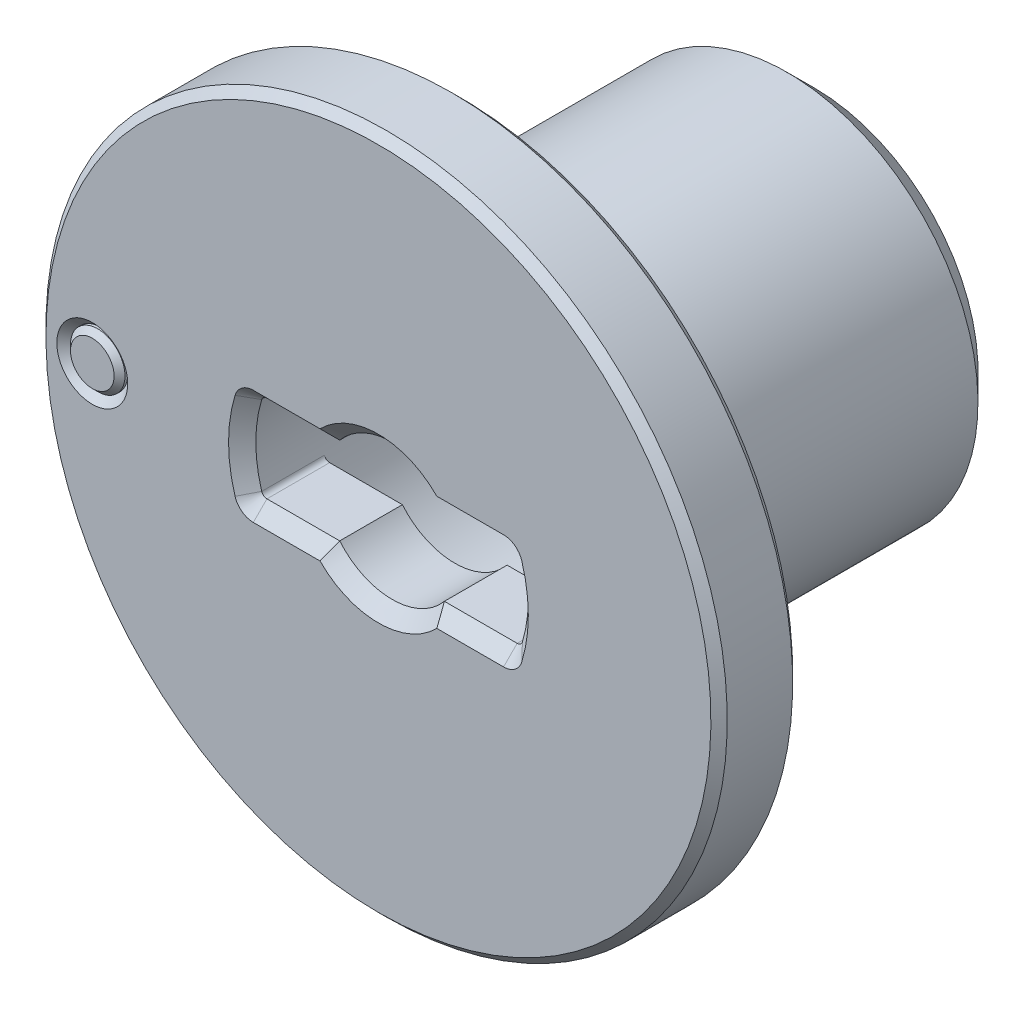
ISO-10303-21;
HEADER;
FILE_DESCRIPTION(('STEP AP214'),'2;1');
FILE_NAME('part.step','',(''),(''),'','','');
FILE_SCHEMA(('AUTOMOTIVE_DESIGN { 1 0 10303 214 1 1 1 1 }'));
ENDSEC;
DATA;
#1=APPLICATION_CONTEXT('core data for automotive mechanical design processes');
#2=APPLICATION_PROTOCOL_DEFINITION('international standard','automotive_design',2000,#1);
#3=PRODUCT_CONTEXT('',#1,'mechanical');
#4=PRODUCT('Part','Part','',(#3));
#5=PRODUCT_RELATED_PRODUCT_CATEGORY('part','',(#4));
#6=PRODUCT_DEFINITION_FORMATION('','',#4);
#7=PRODUCT_DEFINITION_CONTEXT('part definition',#1,'design');
#8=PRODUCT_DEFINITION('design','',#6,#7);
#9=PRODUCT_DEFINITION_SHAPE('','',#8);
#10=(LENGTH_UNIT() NAMED_UNIT(*) SI_UNIT(.MILLI.,.METRE.));
#11=(NAMED_UNIT(*) PLANE_ANGLE_UNIT() SI_UNIT($,.RADIAN.));
#12=(NAMED_UNIT(*) SI_UNIT($,.STERADIAN.) SOLID_ANGLE_UNIT());
#13=UNCERTAINTY_MEASURE_WITH_UNIT(LENGTH_MEASURE(1.E-05),#10,'distance_accuracy_value','');
#14=(GEOMETRIC_REPRESENTATION_CONTEXT(3) GLOBAL_UNCERTAINTY_ASSIGNED_CONTEXT((#13)) GLOBAL_UNIT_ASSIGNED_CONTEXT((#10,
#11,#12)) REPRESENTATION_CONTEXT('',''));
#15=CARTESIAN_POINT('',(0.,0.,0.));
#16=DIRECTION('',(0.,0.,1.));
#17=DIRECTION('',(1.,0.,0.));
#18=AXIS2_PLACEMENT_3D('',#15,#16,#17);
#19=CARTESIAN_POINT('',(-10.5,0.,3.));
#20=DIRECTION('',(0.,0.,1.));
#21=DIRECTION('',(1.,0.,0.));
#22=AXIS2_PLACEMENT_3D('',#19,#20,#21);
#23=PLANE('',#22);
#24=CARTESIAN_POINT('',(-10.5,0.,3.));
#25=DIRECTION('',(0.,0.,1.));
#26=DIRECTION('',(1.,0.,0.));
#27=AXIS2_PLACEMENT_3D('',#24,#25,#26);
#28=CIRCLE('',#27,0.8);
#29=CARTESIAN_POINT('',(-9.7,0.,3.));
#30=VERTEX_POINT('',#29);
#31=EDGE_CURVE('E333',#30,#30,#28,.T.);
#32=ORIENTED_EDGE('',*,*,#31,.T.);
#33=EDGE_LOOP('',(#32));
#34=FACE_BOUND('',#33,.T.);
#35=ADVANCED_FACE('F14',(#34),#23,.T.);
#36=CARTESIAN_POINT('',(-10.5,0.,3.));
#37=DIRECTION('',(0.,0.,-1.));
#38=DIRECTION('',(-1.,0.,0.));
#39=AXIS2_PLACEMENT_3D('',#36,#37,#38);
#40=CONICAL_SURFACE('',#39,0.8,0.785398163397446);
#41=CARTESIAN_POINT('',(-10.5,0.,2.8));
#42=DIRECTION('',(0.,0.,1.));
#43=DIRECTION('',(1.,0.,0.));
#44=AXIS2_PLACEMENT_3D('',#41,#42,#43);
#45=CIRCLE('',#44,1.);
#46=CARTESIAN_POINT('',(-9.5,0.,2.8));
#47=VERTEX_POINT('',#46);
#48=EDGE_CURVE('E335',#47,#47,#45,.F.);
#49=ORIENTED_EDGE('',*,*,#48,.F.);
#50=EDGE_LOOP('',(#49));
#51=FACE_BOUND('',#50,.T.);
#52=ORIENTED_EDGE('',*,*,#31,.F.);
#53=EDGE_LOOP('',(#52));
#54=FACE_BOUND('',#53,.T.);
#55=ADVANCED_FACE('F315',(#51,#54),#40,.T.);
#56=CARTESIAN_POINT('',(-10.5,0.,3.));
#57=DIRECTION('',(0.,0.,-1.));
#58=DIRECTION('',(-1.,0.,0.));
#59=AXIS2_PLACEMENT_3D('',#56,#57,#58);
#60=CYLINDRICAL_SURFACE('',#59,1.);
#61=CARTESIAN_POINT('',(-10.5,0.,2.7));
#62=DIRECTION('',(0.,0.,1.));
#63=DIRECTION('',(0.,-1.,0.));
#64=AXIS2_PLACEMENT_3D('',#61,#62,#63);
#65=CIRCLE('',#64,1.);
#66=CARTESIAN_POINT('',(-10.5,-1.,2.7));
#67=VERTEX_POINT('',#66);
#68=EDGE_CURVE('E23',#67,#67,#65,.T.);
#69=ORIENTED_EDGE('',*,*,#68,.T.);
#70=EDGE_LOOP('',(#69));
#71=FACE_BOUND('',#70,.T.);
#72=ORIENTED_EDGE('',*,*,#48,.T.);
#73=EDGE_LOOP('',(#72));
#74=FACE_BOUND('',#73,.T.);
#75=ADVANCED_FACE('F298',(#71,#74),#60,.T.);
#76=CARTESIAN_POINT('',(-10.5,0.,0.3));
#77=DIRECTION('',(0.,0.,-1.));
#78=DIRECTION('',(0.,1.,0.));
#79=AXIS2_PLACEMENT_3D('',#76,#77,#78);
#80=CIRCLE('',#79,1.);
#81=CARTESIAN_POINT('',(-10.5,1.,0.3));
#82=VERTEX_POINT('',#81);
#83=EDGE_CURVE('E9',#82,#82,#80,.T.);
#84=ORIENTED_EDGE('',*,*,#83,.T.);
#85=EDGE_LOOP('',(#84));
#86=FACE_BOUND('',#85,.T.);
#87=CARTESIAN_POINT('',(-10.5,0.,-1.65));
#88=DIRECTION('',(0.,0.,1.));
#89=DIRECTION('',(1.,0.,0.));
#90=AXIS2_PLACEMENT_3D('',#87,#88,#89);
#91=CIRCLE('',#90,1.);
#92=CARTESIAN_POINT('',(-9.5,0.,-1.65));
#93=VERTEX_POINT('',#92);
#94=EDGE_CURVE('E338',#93,#93,#91,.T.);
#95=ORIENTED_EDGE('',*,*,#94,.T.);
#96=EDGE_LOOP('',(#95));
#97=FACE_BOUND('',#96,.T.);
#98=ADVANCED_FACE('F310',(#86,#97),#60,.T.);
#99=CARTESIAN_POINT('',(-10.5,0.,-2.));
#100=DIRECTION('',(0.,0.,1.));
#101=DIRECTION('',(1.,0.,0.));
#102=AXIS2_PLACEMENT_3D('',#99,#100,#101);
#103=PLANE('',#102);
#104=CARTESIAN_POINT('',(-10.5,0.,-2.));
#105=DIRECTION('',(0.,0.,1.));
#106=DIRECTION('',(1.,0.,0.));
#107=AXIS2_PLACEMENT_3D('',#104,#105,#106);
#108=CIRCLE('',#107,0.906217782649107);
#109=CARTESIAN_POINT('',(-9.59378221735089,0.,-2.));
#110=VERTEX_POINT('',#109);
#111=EDGE_CURVE('E344',#110,#110,#108,.F.);
#112=ORIENTED_EDGE('',*,*,#111,.T.);
#113=EDGE_LOOP('',(#112));
#114=FACE_BOUND('',#113,.T.);
#115=ADVANCED_FACE('F313',(#114),#103,.F.);
#116=CARTESIAN_POINT('',(-10.5,0.,-1.65));
#117=DIRECTION('',(0.,0.,1.));
#118=DIRECTION('',(1.,0.,0.));
#119=AXIS2_PLACEMENT_3D('',#116,#117,#118);
#120=CONICAL_SURFACE('',#119,1.,0.261799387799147);
#121=ORIENTED_EDGE('',*,*,#111,.F.);
#122=EDGE_LOOP('',(#121));
#123=FACE_BOUND('',#122,.T.);
#124=ORIENTED_EDGE('',*,*,#94,.F.);
#125=EDGE_LOOP('',(#124));
#126=FACE_BOUND('',#125,.T.);
#127=ADVANCED_FACE('F255',(#123,#126),#120,.T.);
#128=CARTESIAN_POINT('',(0.,0.,-12.));
#129=DIRECTION('',(0.,0.,1.));
#130=DIRECTION('',(0.,-1.,0.));
#131=AXIS2_PLACEMENT_3D('',#128,#129,#130);
#132=CONICAL_SURFACE('',#131,7.,0.785398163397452);
#133=CARTESIAN_POINT('',(0.,0.,-13.));
#134=DIRECTION('',(0.,0.,1.));
#135=DIRECTION('',(0.,-1.,0.));
#136=AXIS2_PLACEMENT_3D('',#133,#134,#135);
#137=CIRCLE('',#136,6.);
#138=CARTESIAN_POINT('',(0.,-6.,-13.));
#139=VERTEX_POINT('',#138);
#140=EDGE_CURVE('E397',#139,#139,#137,.F.);
#141=ORIENTED_EDGE('',*,*,#140,.F.);
#142=EDGE_LOOP('',(#141));
#143=FACE_BOUND('',#142,.T.);
#144=CARTESIAN_POINT('',(0.,0.,-12.));
#145=DIRECTION('',(0.,0.,1.));
#146=DIRECTION('',(0.,-1.,0.));
#147=AXIS2_PLACEMENT_3D('',#144,#145,#146);
#148=CIRCLE('',#147,7.);
#149=CARTESIAN_POINT('',(0.,-7.,-12.));
#150=VERTEX_POINT('',#149);
#151=EDGE_CURVE('E394',#150,#150,#148,.T.);
#152=ORIENTED_EDGE('',*,*,#151,.F.);
#153=EDGE_LOOP('',(#152));
#154=FACE_BOUND('',#153,.T.);
#155=ADVANCED_FACE('F250',(#143,#154),#132,.T.);
#156=CARTESIAN_POINT('',(7.,0.,-13.));
#157=DIRECTION('',(0.,0.,1.));
#158=DIRECTION('',(0.,-1.,0.));
#159=AXIS2_PLACEMENT_3D('',#156,#157,#158);
#160=PLANE('',#159);
#161=ORIENTED_EDGE('',*,*,#140,.T.);
#162=EDGE_LOOP('',(#161));
#163=FACE_BOUND('',#162,.T.);
#164=CARTESIAN_POINT('',(0.,0.,-13.));
#165=DIRECTION('',(0.,0.,1.));
#166=DIRECTION('',(0.,-1.,0.));
#167=AXIS2_PLACEMENT_3D('',#164,#165,#166);
#168=CIRCLE('',#167,5.);
#169=CARTESIAN_POINT('',(0.,-5.,-13.));
#170=VERTEX_POINT('',#169);
#171=EDGE_CURVE('E370',#170,#170,#168,.T.);
#172=ORIENTED_EDGE('',*,*,#171,.T.);
#173=EDGE_LOOP('',(#172));
#174=FACE_BOUND('',#173,.T.);
#175=ADVANCED_FACE('F254',(#163,#174),#160,.F.);
#176=CARTESIAN_POINT('',(0.,0.,0.2));
#177=DIRECTION('',(0.,0.,1.));
#178=DIRECTION('',(0.,-1.,0.));
#179=AXIS2_PLACEMENT_3D('',#176,#177,#178);
#180=PLANE('',#179);
#181=CARTESIAN_POINT('',(0.,0.,0.2));
#182=DIRECTION('',(0.,0.,1.));
#183=DIRECTION('',(0.,-1.,0.));
#184=AXIS2_PLACEMENT_3D('',#181,#182,#183);
#185=CIRCLE('',#184,5.);
#186=CARTESIAN_POINT('',(-4.78260011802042,-1.45833333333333,0.2));
#187=VERTEX_POINT('',#186);
#188=CARTESIAN_POINT('',(4.78260011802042,-1.45833333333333,0.2));
#189=VERTEX_POINT('',#188);
#190=EDGE_CURVE('E39',#187,#189,#185,.T.);
#191=ORIENTED_EDGE('',*,*,#190,.F.);
#192=CARTESIAN_POINT('',(-4.5912961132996,-1.4,0.2));
#193=DIRECTION('',(0.,0.,1.));
#194=DIRECTION('',(0.,-1.,0.));
#195=AXIS2_PLACEMENT_3D('',#192,#193,#194);
#196=CIRCLE('',#195,0.2);
#197=CARTESIAN_POINT('',(-4.5912961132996,-1.6,0.2));
#198=VERTEX_POINT('',#197);
#199=EDGE_CURVE('E18',#198,#187,#196,.F.);
#200=ORIENTED_EDGE('',*,*,#199,.F.);
#201=DIRECTION('',(-1.,0.,0.));
#202=VECTOR('',#201,1.);
#203=CARTESIAN_POINT('',(-4.73708771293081,-1.6,0.2));
#204=LINE('',#203,#202);
#205=CARTESIAN_POINT('',(-1.92093727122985,-1.6,0.2));
#206=VERTEX_POINT('',#205);
#207=EDGE_CURVE('E349',#206,#198,#204,.T.);
#208=ORIENTED_EDGE('',*,*,#207,.F.);
#209=CARTESIAN_POINT('',(0.,0.,0.2));
#210=DIRECTION('',(0.,0.,1.));
#211=DIRECTION('',(0.,-1.,0.));
#212=AXIS2_PLACEMENT_3D('',#209,#210,#211);
#213=CIRCLE('',#212,2.5);
#214=CARTESIAN_POINT('',(1.92093727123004,-1.59999999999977,0.2));
#215=VERTEX_POINT('',#214);
#216=EDGE_CURVE('E352',#215,#206,#213,.F.);
#217=ORIENTED_EDGE('',*,*,#216,.F.);
#218=DIRECTION('',(-1.,0.,0.));
#219=VECTOR('',#218,1.);
#220=CARTESIAN_POINT('',(-4.73708771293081,-1.6,0.2));
#221=LINE('',#220,#219);
#222=CARTESIAN_POINT('',(4.5912961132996,-1.6,0.2));
#223=VERTEX_POINT('',#222);
#224=EDGE_CURVE('E142',#223,#215,#221,.T.);
#225=ORIENTED_EDGE('',*,*,#224,.F.);
#226=CARTESIAN_POINT('',(4.5912961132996,-1.4,0.2));
#227=DIRECTION('',(0.,0.,1.));
#228=DIRECTION('',(0.,-1.,0.));
#229=AXIS2_PLACEMENT_3D('',#226,#227,#228);
#230=CIRCLE('',#229,0.2);
#231=EDGE_CURVE('E139',#189,#223,#230,.F.);
#232=ORIENTED_EDGE('',*,*,#231,.F.);
#233=EDGE_LOOP('',(#191,#200,#208,#217,#225,#232));
#234=FACE_BOUND('',#233,.T.);
#235=ADVANCED_FACE('F140',(#234),#180,.F.);
#236=DIRECTION('',(1.,0.,0.));
#237=VECTOR('',#236,1.);
#238=CARTESIAN_POINT('',(-4.73708771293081,1.6,0.2));
#239=LINE('',#238,#237);
#240=CARTESIAN_POINT('',(1.92093727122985,1.6,0.2));
#241=VERTEX_POINT('',#240);
#242=CARTESIAN_POINT('',(4.5912961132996,1.6,0.2));
#243=VERTEX_POINT('',#242);
#244=EDGE_CURVE('E361',#241,#243,#239,.T.);
#245=ORIENTED_EDGE('',*,*,#244,.F.);
#246=CARTESIAN_POINT('',(0.,0.,0.2));
#247=DIRECTION('',(0.,0.,1.));
#248=DIRECTION('',(0.,-1.,0.));
#249=AXIS2_PLACEMENT_3D('',#246,#247,#248);
#250=CIRCLE('',#249,2.5);
#251=CARTESIAN_POINT('',(-1.92093727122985,1.6,0.2));
#252=VERTEX_POINT('',#251);
#253=EDGE_CURVE('E358',#252,#241,#250,.F.);
#254=ORIENTED_EDGE('',*,*,#253,.F.);
#255=DIRECTION('',(1.,0.,0.));
#256=VECTOR('',#255,1.);
#257=CARTESIAN_POINT('',(-4.73708771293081,1.6,0.2));
#258=LINE('',#257,#256);
#259=CARTESIAN_POINT('',(-4.5912961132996,1.6,0.2));
#260=VERTEX_POINT('',#259);
#261=EDGE_CURVE('E31',#260,#252,#258,.T.);
#262=ORIENTED_EDGE('',*,*,#261,.F.);
#263=CARTESIAN_POINT('',(-4.5912961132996,1.4,0.2));
#264=DIRECTION('',(0.,0.,1.));
#265=DIRECTION('',(0.,-1.,0.));
#266=AXIS2_PLACEMENT_3D('',#263,#264,#265);
#267=CIRCLE('',#266,0.2);
#268=CARTESIAN_POINT('',(-4.78260011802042,1.45833333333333,0.2));
#269=VERTEX_POINT('',#268);
#270=EDGE_CURVE('E147',#269,#260,#267,.F.);
#271=ORIENTED_EDGE('',*,*,#270,.F.);
#272=CARTESIAN_POINT('',(4.78260011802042,1.45833333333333,0.2));
#273=VERTEX_POINT('',#272);
#274=EDGE_CURVE('E158',#273,#269,#185,.T.);
#275=ORIENTED_EDGE('',*,*,#274,.F.);
#276=CARTESIAN_POINT('',(4.5912961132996,1.4,0.2));
#277=DIRECTION('',(0.,0.,1.));
#278=DIRECTION('',(0.,-1.,0.));
#279=AXIS2_PLACEMENT_3D('',#276,#277,#278);
#280=CIRCLE('',#279,0.2);
#281=EDGE_CURVE('E364',#243,#273,#280,.F.);
#282=ORIENTED_EDGE('',*,*,#281,.F.);
#283=EDGE_LOOP('',(#245,#254,#262,#271,#275,#282));
#284=FACE_BOUND('',#283,.T.);
#285=ADVANCED_FACE('F307',(#284),#180,.F.);
#286=CARTESIAN_POINT('',(-4.73708771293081,1.6,-1.884875));
#287=DIRECTION('',(0.,1.,0.));
#288=DIRECTION('',(-1.,0.,0.));
#289=AXIS2_PLACEMENT_3D('',#286,#287,#288);
#290=PLANE('',#289);
#291=DIRECTION('',(0.,0.,-1.));
#292=VECTOR('',#291,1.);
#293=CARTESIAN_POINT('',(-4.5912961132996,1.6,0.11225012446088));
#294=LINE('',#293,#292);
#295=CARTESIAN_POINT('',(-4.5912961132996,1.6,2.5));
#296=VERTEX_POINT('',#295);
#297=EDGE_CURVE('E174',#296,#260,#294,.T.);
#298=ORIENTED_EDGE('',*,*,#297,.T.);
#299=ORIENTED_EDGE('',*,*,#261,.T.);
#300=DIRECTION('',(0.,0.,1.));
#301=VECTOR('',#300,1.);
#302=CARTESIAN_POINT('',(-1.92093727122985,1.6,-7.));
#303=LINE('',#302,#301);
#304=CARTESIAN_POINT('',(-1.92093727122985,1.6,2.5));
#305=VERTEX_POINT('',#304);
#306=EDGE_CURVE('E377',#305,#252,#303,.F.);
#307=ORIENTED_EDGE('',*,*,#306,.F.);
#308=DIRECTION('',(-1.,0.,0.));
#309=VECTOR('',#308,1.);
#310=CARTESIAN_POINT('',(-4.5912961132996,1.6,2.5));
#311=LINE('',#310,#309);
#312=EDGE_CURVE('E432',#305,#296,#311,.T.);
#313=ORIENTED_EDGE('',*,*,#312,.T.);
#314=EDGE_LOOP('',(#298,#299,#307,#313));
#315=FACE_BOUND('',#314,.T.);
#316=ADVANCED_FACE('F281',(#315),#290,.F.);
#317=CARTESIAN_POINT('',(-4.5912961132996,1.4,3.));
#318=DIRECTION('',(0.,0.,1.));
#319=DIRECTION('',(0.,-1.,0.));
#320=AXIS2_PLACEMENT_3D('',#317,#318,#319);
#321=CYLINDRICAL_SURFACE('',#320,0.2);
#322=DIRECTION('',(0.,0.,1.));
#323=VECTOR('',#322,1.);
#324=CARTESIAN_POINT('',(-4.78260011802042,1.45833333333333,3.));
#325=LINE('',#324,#323);
#326=CARTESIAN_POINT('',(-4.78260011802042,1.45833333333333,2.5));
#327=VERTEX_POINT('',#326);
#328=EDGE_CURVE('E169',#269,#327,#325,.T.);
#329=ORIENTED_EDGE('',*,*,#328,.F.);
#330=ORIENTED_EDGE('',*,*,#270,.T.);
#331=ORIENTED_EDGE('',*,*,#297,.F.);
#332=CARTESIAN_POINT('',(-4.5912961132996,1.4,2.5));
#333=DIRECTION('',(0.,0.,1.));
#334=DIRECTION('',(0.,-1.,0.));
#335=AXIS2_PLACEMENT_3D('',#332,#333,#334);
#336=CIRCLE('',#335,0.2);
#337=EDGE_CURVE('E426',#296,#327,#336,.T.);
#338=ORIENTED_EDGE('',*,*,#337,.T.);
#339=EDGE_LOOP('',(#329,#330,#331,#338));
#340=FACE_BOUND('',#339,.T.);
#341=ADVANCED_FACE('F427',(#340),#321,.F.);
#342=CARTESIAN_POINT('',(-4.5912961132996,-1.4,3.));
#343=DIRECTION('',(0.,0.,1.));
#344=DIRECTION('',(0.,-1.,0.));
#345=AXIS2_PLACEMENT_3D('',#342,#343,#344);
#346=CYLINDRICAL_SURFACE('',#345,0.2);
#347=DIRECTION('',(0.,0.,-1.));
#348=VECTOR('',#347,1.);
#349=CARTESIAN_POINT('',(-4.5912961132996,-1.6,3.));
#350=LINE('',#349,#348);
#351=CARTESIAN_POINT('',(-4.5912961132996,-1.6,2.5));
#352=VERTEX_POINT('',#351);
#353=EDGE_CURVE('E177',#198,#352,#350,.F.);
#354=ORIENTED_EDGE('',*,*,#353,.F.);
#355=ORIENTED_EDGE('',*,*,#199,.T.);
#356=DIRECTION('',(0.,0.,1.));
#357=VECTOR('',#356,1.);
#358=CARTESIAN_POINT('',(-4.78260011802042,-1.45833333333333,3.));
#359=LINE('',#358,#357);
#360=CARTESIAN_POINT('',(-4.78260011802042,-1.45833333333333,2.5));
#361=VERTEX_POINT('',#360);
#362=EDGE_CURVE('E157',#361,#187,#359,.F.);
#363=ORIENTED_EDGE('',*,*,#362,.F.);
#364=CARTESIAN_POINT('',(-4.5912961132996,-1.4,2.5));
#365=DIRECTION('',(0.,0.,1.));
#366=DIRECTION('',(0.,-1.,0.));
#367=AXIS2_PLACEMENT_3D('',#364,#365,#366);
#368=CIRCLE('',#367,0.2);
#369=EDGE_CURVE('E431',#361,#352,#368,.T.);
#370=ORIENTED_EDGE('',*,*,#369,.T.);
#371=EDGE_LOOP('',(#354,#355,#363,#370));
#372=FACE_BOUND('',#371,.T.);
#373=ADVANCED_FACE('F305',(#372),#346,.F.);
#374=CARTESIAN_POINT('',(-4.73708771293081,-1.6,-1.884875));
#375=DIRECTION('',(0.,-1.,0.));
#376=DIRECTION('',(1.,0.,0.));
#377=AXIS2_PLACEMENT_3D('',#374,#375,#376);
#378=PLANE('',#377);
#379=DIRECTION('',(0.,0.,1.));
#380=VECTOR('',#379,1.);
#381=CARTESIAN_POINT('',(-1.92093727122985,-1.6,-7.));
#382=LINE('',#381,#380);
#383=CARTESIAN_POINT('',(-1.92093727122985,-1.6,2.5));
#384=VERTEX_POINT('',#383);
#385=EDGE_CURVE('E368',#206,#384,#382,.T.);
#386=ORIENTED_EDGE('',*,*,#385,.F.);
#387=ORIENTED_EDGE('',*,*,#207,.T.);
#388=ORIENTED_EDGE('',*,*,#353,.T.);
#389=DIRECTION('',(1.,0.,0.));
#390=VECTOR('',#389,1.);
#391=CARTESIAN_POINT('',(-2.53771550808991,-1.6,2.5));
#392=LINE('',#391,#390);
#393=EDGE_CURVE('E456',#352,#384,#392,.T.);
#394=ORIENTED_EDGE('',*,*,#393,.T.);
#395=EDGE_LOOP('',(#386,#387,#388,#394));
#396=FACE_BOUND('',#395,.T.);
#397=ADVANCED_FACE('F301',(#396),#378,.F.);
#398=CARTESIAN_POINT('',(0.,0.,-7.));
#399=DIRECTION('',(0.,0.,1.));
#400=DIRECTION('',(0.,-1.,0.));
#401=AXIS2_PLACEMENT_3D('',#398,#399,#400);
#402=CYLINDRICAL_SURFACE('',#401,2.5);
#403=DIRECTION('',(0.,0.,1.));
#404=VECTOR('',#403,1.);
#405=CARTESIAN_POINT('',(1.92093727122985,-1.6,-7.));
#406=LINE('',#405,#404);
#407=CARTESIAN_POINT('',(1.92093727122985,-1.6,2.5));
#408=VERTEX_POINT('',#407);
#409=EDGE_CURVE('E371',#408,#215,#406,.F.);
#410=ORIENTED_EDGE('',*,*,#409,.T.);
#411=ORIENTED_EDGE('',*,*,#216,.T.);
#412=ORIENTED_EDGE('',*,*,#385,.T.);
#413=CARTESIAN_POINT('',(0.,0.,2.5));
#414=DIRECTION('',(0.,0.,1.));
#415=DIRECTION('',(0.,-1.,0.));
#416=AXIS2_PLACEMENT_3D('',#413,#414,#415);
#417=CIRCLE('',#416,2.5);
#418=EDGE_CURVE('E400',#384,#408,#417,.T.);
#419=ORIENTED_EDGE('',*,*,#418,.T.);
#420=EDGE_LOOP('',(#410,#411,#412,#419));
#421=FACE_BOUND('',#420,.T.);
#422=ADVANCED_FACE('F295',(#421),#402,.F.);
#423=DIRECTION('',(0.,0.,-1.));
#424=VECTOR('',#423,1.);
#425=CARTESIAN_POINT('',(4.5912961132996,-1.6,0.112250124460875));
#426=LINE('',#425,#424);
#427=CARTESIAN_POINT('',(4.5912961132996,-1.6,2.5));
#428=VERTEX_POINT('',#427);
#429=EDGE_CURVE('E164',#428,#223,#426,.T.);
#430=ORIENTED_EDGE('',*,*,#429,.T.);
#431=ORIENTED_EDGE('',*,*,#224,.T.);
#432=ORIENTED_EDGE('',*,*,#409,.F.);
#433=DIRECTION('',(1.,0.,0.));
#434=VECTOR('',#433,1.);
#435=CARTESIAN_POINT('',(4.5912961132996,-1.6,2.5));
#436=LINE('',#435,#434);
#437=EDGE_CURVE('E239',#408,#428,#436,.T.);
#438=ORIENTED_EDGE('',*,*,#437,.T.);
#439=EDGE_LOOP('',(#430,#431,#432,#438));
#440=FACE_BOUND('',#439,.T.);
#441=ADVANCED_FACE('F268',(#440),#378,.F.);
#442=CARTESIAN_POINT('',(4.5912961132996,-1.4,3.));
#443=DIRECTION('',(0.,0.,1.));
#444=DIRECTION('',(0.,-1.,0.));
#445=AXIS2_PLACEMENT_3D('',#442,#443,#444);
#446=CYLINDRICAL_SURFACE('',#445,0.2);
#447=DIRECTION('',(0.,0.,1.));
#448=VECTOR('',#447,1.);
#449=CARTESIAN_POINT('',(4.78260011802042,-1.45833333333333,3.));
#450=LINE('',#449,#448);
#451=CARTESIAN_POINT('',(4.78260011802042,-1.45833333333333,2.5));
#452=VERTEX_POINT('',#451);
#453=EDGE_CURVE('E154',#189,#452,#450,.T.);
#454=ORIENTED_EDGE('',*,*,#453,.F.);
#455=ORIENTED_EDGE('',*,*,#231,.T.);
#456=ORIENTED_EDGE('',*,*,#429,.F.);
#457=CARTESIAN_POINT('',(4.5912961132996,-1.4,2.5));
#458=DIRECTION('',(0.,0.,1.));
#459=DIRECTION('',(0.,-1.,0.));
#460=AXIS2_PLACEMENT_3D('',#457,#458,#459);
#461=CIRCLE('',#460,0.2);
#462=EDGE_CURVE('E162',#428,#452,#461,.T.);
#463=ORIENTED_EDGE('',*,*,#462,.T.);
#464=EDGE_LOOP('',(#454,#455,#456,#463));
#465=FACE_BOUND('',#464,.T.);
#466=ADVANCED_FACE('F160',(#465),#446,.F.);
#467=CARTESIAN_POINT('',(0.,0.,3.));
#468=DIRECTION('',(0.,0.,1.));
#469=DIRECTION('',(0.,-1.,0.));
#470=AXIS2_PLACEMENT_3D('',#467,#468,#469);
#471=CYLINDRICAL_SURFACE('',#470,5.);
#472=DIRECTION('',(0.,0.,1.));
#473=VECTOR('',#472,1.);
#474=CARTESIAN_POINT('',(4.78260011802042,1.45833333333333,3.));
#475=LINE('',#474,#473);
#476=CARTESIAN_POINT('',(4.78260011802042,1.45833333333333,2.5));
#477=VERTEX_POINT('',#476);
#478=EDGE_CURVE('E165',#477,#273,#475,.F.);
#479=ORIENTED_EDGE('',*,*,#478,.T.);
#480=ORIENTED_EDGE('',*,*,#274,.T.);
#481=ORIENTED_EDGE('',*,*,#328,.T.);
#482=CARTESIAN_POINT('',(0.,0.,2.5));
#483=DIRECTION('',(0.,0.,1.));
#484=DIRECTION('',(0.,-1.,0.));
#485=AXIS2_PLACEMENT_3D('',#482,#483,#484);
#486=CIRCLE('',#485,5.);
#487=EDGE_CURVE('E422',#327,#361,#486,.T.);
#488=ORIENTED_EDGE('',*,*,#487,.T.);
#489=ORIENTED_EDGE('',*,*,#362,.T.);
#490=ORIENTED_EDGE('',*,*,#190,.T.);
#491=ORIENTED_EDGE('',*,*,#453,.T.);
#492=CARTESIAN_POINT('',(0.,0.,2.5));
#493=DIRECTION('',(0.,0.,1.));
#494=DIRECTION('',(0.,-1.,0.));
#495=AXIS2_PLACEMENT_3D('',#492,#493,#494);
#496=CIRCLE('',#495,5.);
#497=EDGE_CURVE('E441',#452,#477,#496,.T.);
#498=ORIENTED_EDGE('',*,*,#497,.T.);
#499=EDGE_LOOP('',(#479,#480,#481,#488,#489,#490,#491,#498));
#500=FACE_BOUND('',#499,.T.);
#501=ORIENTED_EDGE('',*,*,#171,.F.);
#502=EDGE_LOOP('',(#501));
#503=FACE_BOUND('',#502,.T.);
#504=ADVANCED_FACE('F152',(#500,#503),#471,.F.);
#505=CARTESIAN_POINT('',(4.5912961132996,1.4,3.));
#506=DIRECTION('',(0.,0.,1.));
#507=DIRECTION('',(0.,-1.,0.));
#508=AXIS2_PLACEMENT_3D('',#505,#506,#507);
#509=CYLINDRICAL_SURFACE('',#508,0.2);
#510=DIRECTION('',(0.,0.,-1.));
#511=VECTOR('',#510,1.);
#512=CARTESIAN_POINT('',(4.5912961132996,1.6,3.));
#513=LINE('',#512,#511);
#514=CARTESIAN_POINT('',(4.5912961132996,1.6,2.5));
#515=VERTEX_POINT('',#514);
#516=EDGE_CURVE('E167',#243,#515,#513,.F.);
#517=ORIENTED_EDGE('',*,*,#516,.F.);
#518=ORIENTED_EDGE('',*,*,#281,.T.);
#519=ORIENTED_EDGE('',*,*,#478,.F.);
#520=CARTESIAN_POINT('',(4.5912961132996,1.4,2.5));
#521=DIRECTION('',(0.,0.,1.));
#522=DIRECTION('',(0.,-1.,0.));
#523=AXIS2_PLACEMENT_3D('',#520,#521,#522);
#524=CIRCLE('',#523,0.2);
#525=EDGE_CURVE('E442',#477,#515,#524,.T.);
#526=ORIENTED_EDGE('',*,*,#525,.T.);
#527=EDGE_LOOP('',(#517,#518,#519,#526));
#528=FACE_BOUND('',#527,.T.);
#529=ADVANCED_FACE('F279',(#528),#509,.F.);
#530=DIRECTION('',(0.,0.,1.));
#531=VECTOR('',#530,1.);
#532=CARTESIAN_POINT('',(1.92093727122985,1.6,-7.));
#533=LINE('',#532,#531);
#534=CARTESIAN_POINT('',(1.92093727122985,1.6,2.5));
#535=VERTEX_POINT('',#534);
#536=EDGE_CURVE('E380',#241,#535,#533,.T.);
#537=ORIENTED_EDGE('',*,*,#536,.F.);
#538=ORIENTED_EDGE('',*,*,#244,.T.);
#539=ORIENTED_EDGE('',*,*,#516,.T.);
#540=DIRECTION('',(-1.,0.,0.));
#541=VECTOR('',#540,1.);
#542=CARTESIAN_POINT('',(2.53771550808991,1.6,2.5));
#543=LINE('',#542,#541);
#544=EDGE_CURVE('E179',#515,#535,#543,.T.);
#545=ORIENTED_EDGE('',*,*,#544,.T.);
#546=EDGE_LOOP('',(#537,#538,#539,#545));
#547=FACE_BOUND('',#546,.T.);
#548=ADVANCED_FACE('F275',(#547),#290,.F.);
#549=CARTESIAN_POINT('',(0.,0.,-7.));
#550=DIRECTION('',(0.,0.,1.));
#551=DIRECTION('',(0.,-1.,0.));
#552=AXIS2_PLACEMENT_3D('',#549,#550,#551);
#553=CYLINDRICAL_SURFACE('',#552,2.5);
#554=ORIENTED_EDGE('',*,*,#306,.T.);
#555=ORIENTED_EDGE('',*,*,#253,.T.);
#556=ORIENTED_EDGE('',*,*,#536,.T.);
#557=CARTESIAN_POINT('',(0.,0.,2.5));
#558=DIRECTION('',(0.,0.,1.));
#559=DIRECTION('',(0.,-1.,0.));
#560=AXIS2_PLACEMENT_3D('',#557,#558,#559);
#561=CIRCLE('',#560,2.5);
#562=EDGE_CURVE('E409',#535,#305,#561,.T.);
#563=ORIENTED_EDGE('',*,*,#562,.T.);
#564=EDGE_LOOP('',(#554,#555,#556,#563));
#565=FACE_BOUND('',#564,.T.);
#566=ADVANCED_FACE('F272',(#565),#553,.F.);
#567=CARTESIAN_POINT('',(0.,0.,3.));
#568=DIRECTION('',(0.,0.,1.));
#569=DIRECTION('',(0.,-1.,0.));
#570=AXIS2_PLACEMENT_3D('',#567,#568,#569);
#571=CYLINDRICAL_SURFACE('',#570,12.5);
#572=CARTESIAN_POINT('',(0.,0.,0.3));
#573=DIRECTION('',(0.,0.,1.));
#574=DIRECTION('',(0.,-1.,0.));
#575=AXIS2_PLACEMENT_3D('',#572,#573,#574);
#576=CIRCLE('',#575,12.5);
#577=CARTESIAN_POINT('',(0.,-12.5,0.3));
#578=VERTEX_POINT('',#577);
#579=EDGE_CURVE('E388',#578,#578,#576,.T.);
#580=ORIENTED_EDGE('',*,*,#579,.T.);
#581=EDGE_LOOP('',(#580));
#582=FACE_BOUND('',#581,.T.);
#583=CARTESIAN_POINT('',(0.,0.,2.7));
#584=DIRECTION('',(0.,0.,1.));
#585=DIRECTION('',(0.,-1.,0.));
#586=AXIS2_PLACEMENT_3D('',#583,#584,#585);
#587=CIRCLE('',#586,12.5);
#588=CARTESIAN_POINT('',(0.,-12.5,2.7));
#589=VERTEX_POINT('',#588);
#590=EDGE_CURVE('E385',#589,#589,#587,.F.);
#591=ORIENTED_EDGE('',*,*,#590,.T.);
#592=EDGE_LOOP('',(#591));
#593=FACE_BOUND('',#592,.T.);
#594=ADVANCED_FACE('F207',(#582,#593),#571,.T.);
#595=CARTESIAN_POINT('',(-4.73708771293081,1.6,2.5));
#596=DIRECTION('',(0.,-0.707106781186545,0.70710678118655));
#597=DIRECTION('',(0.,-0.70710678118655,-0.707106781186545));
#598=AXIS2_PLACEMENT_3D('',#595,#596,#597);
#599=PLANE('',#598);
#600=CARTESIAN_POINT('',(-2.14242852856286,2.1,3.));
#601=CARTESIAN_POINT('',(-2.12484409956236,2.05814213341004,2.95814213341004));
#602=CARTESIAN_POINT('',(-2.10706179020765,2.01632566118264,2.91632566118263));
#603=CARTESIAN_POINT('',(-2.07107243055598,1.93278699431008,2.83278699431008));
#604=CARTESIAN_POINT('',(-2.05286540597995,1.89106479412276,2.79106479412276));
#605=CARTESIAN_POINT('',(-2.01599527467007,1.80772054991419,2.70772054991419));
#606=CARTESIAN_POINT('',(-1.99733216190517,1.76609850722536,2.66609850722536));
#607=CARTESIAN_POINT('',(-1.95951308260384,1.68296379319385,2.58296379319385));
#608=CARTESIAN_POINT('',(-1.94035708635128,1.64145112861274,2.54145112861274));
#609=CARTESIAN_POINT('',(-1.92093727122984,1.6,2.5));
#610=B_SPLINE_CURVE_WITH_KNOTS('',3,(#600,#601,#602,#603,#604,#605,#606,#607,#608,#609),
.UNSPECIFIED.,.F.,.F.,(4,2,2,2,4),(0.,0.185257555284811,0.370503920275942,0.555752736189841,
0.741012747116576),.UNSPECIFIED.);
#611=CARTESIAN_POINT('',(-2.14242852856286,2.1,3.));
#612=VERTEX_POINT('',#611);
#613=EDGE_CURVE('E182',#612,#305,#610,.T.);
#614=ORIENTED_EDGE('',*,*,#613,.F.);
#615=DIRECTION('',(1.,0.,0.));
#616=VECTOR('',#615,1.);
#617=CARTESIAN_POINT('',(-2.53771550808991,2.1,3.));
#618=LINE('',#617,#616);
#619=CARTESIAN_POINT('',(-4.5912961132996,2.1,3.));
#620=VERTEX_POINT('',#619);
#621=EDGE_CURVE('E494',#620,#612,#618,.T.);
#622=ORIENTED_EDGE('',*,*,#621,.F.);
#623=DIRECTION('',(0.,-0.70710678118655,-0.707106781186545));
#624=VECTOR('',#623,1.);
#625=CARTESIAN_POINT('',(-4.5912961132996,2.1,3.));
#626=LINE('',#625,#624);
#627=EDGE_CURVE('E367',#620,#296,#626,.T.);
#628=ORIENTED_EDGE('',*,*,#627,.T.);
#629=ORIENTED_EDGE('',*,*,#312,.F.);
#630=EDGE_LOOP('',(#614,#622,#628,#629));
#631=FACE_BOUND('',#630,.T.);
#632=ADVANCED_FACE('F201',(#631),#599,.T.);
#633=CARTESIAN_POINT('',(-4.5912961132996,1.4,3.));
#634=DIRECTION('',(0.,0.,1.));
#635=DIRECTION('',(0.,-1.,0.));
#636=AXIS2_PLACEMENT_3D('',#633,#634,#635);
#637=CONICAL_SURFACE('',#636,0.700000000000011,0.785398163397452);
#638=DIRECTION('',(0.676361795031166,-0.206239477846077,-0.707106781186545));
#639=VECTOR('',#638,1.);
#640=CARTESIAN_POINT('',(-5.26086012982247,1.60416666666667,3.));
#641=LINE('',#640,#639);
#642=CARTESIAN_POINT('',(-5.26086012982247,1.60416666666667,3.));
#643=VERTEX_POINT('',#642);
#644=EDGE_CURVE('E437',#643,#327,#641,.T.);
#645=ORIENTED_EDGE('',*,*,#644,.T.);
#646=ORIENTED_EDGE('',*,*,#337,.F.);
#647=ORIENTED_EDGE('',*,*,#627,.F.);
#648=CARTESIAN_POINT('',(-4.5912961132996,1.4,3.));
#649=DIRECTION('',(0.,0.,1.));
#650=DIRECTION('',(0.,-1.,0.));
#651=AXIS2_PLACEMENT_3D('',#648,#649,#650);
#652=CIRCLE('',#651,0.700000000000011);
#653=EDGE_CURVE('E444',#643,#620,#652,.F.);
#654=ORIENTED_EDGE('',*,*,#653,.F.);
#655=EDGE_LOOP('',(#645,#646,#647,#654));
#656=FACE_BOUND('',#655,.T.);
#657=ADVANCED_FACE('F206',(#656),#637,.F.);
#658=CARTESIAN_POINT('',(0.,0.,2.5));
#659=DIRECTION('',(0.,0.,1.));
#660=DIRECTION('',(0.,-1.,0.));
#661=AXIS2_PLACEMENT_3D('',#658,#659,#660);
#662=CONICAL_SURFACE('',#661,5.,0.785398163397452);
#663=DIRECTION('',(0.676361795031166,0.206239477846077,-0.707106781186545));
#664=VECTOR('',#663,1.);
#665=CARTESIAN_POINT('',(-5.26086012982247,-1.60416666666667,3.));
#666=LINE('',#665,#664);
#667=CARTESIAN_POINT('',(-5.26086012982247,-1.60416666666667,3.));
#668=VERTEX_POINT('',#667);
#669=EDGE_CURVE('E440',#668,#361,#666,.T.);
#670=ORIENTED_EDGE('',*,*,#669,.T.);
#671=ORIENTED_EDGE('',*,*,#487,.F.);
#672=ORIENTED_EDGE('',*,*,#644,.F.);
#673=CARTESIAN_POINT('',(0.,0.,3.));
#674=DIRECTION('',(0.,0.,1.));
#675=DIRECTION('',(0.,-1.,0.));
#676=AXIS2_PLACEMENT_3D('',#673,#674,#675);
#677=CIRCLE('',#676,5.5);
#678=EDGE_CURVE('E555',#668,#643,#677,.F.);
#679=ORIENTED_EDGE('',*,*,#678,.F.);
#680=EDGE_LOOP('',(#670,#671,#672,#679));
#681=FACE_BOUND('',#680,.T.);
#682=ADVANCED_FACE('F215',(#681),#662,.F.);
#683=CARTESIAN_POINT('',(-4.5912961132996,-1.4,3.));
#684=DIRECTION('',(0.,0.,1.));
#685=DIRECTION('',(0.,-1.,0.));
#686=AXIS2_PLACEMENT_3D('',#683,#684,#685);
#687=CONICAL_SURFACE('',#686,0.700000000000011,0.785398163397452);
#688=DIRECTION('',(0.,0.70710678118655,-0.707106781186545));
#689=VECTOR('',#688,1.);
#690=CARTESIAN_POINT('',(-4.5912961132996,-2.1,3.));
#691=LINE('',#690,#689);
#692=CARTESIAN_POINT('',(-4.5912961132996,-2.1,3.));
#693=VERTEX_POINT('',#692);
#694=EDGE_CURVE('E446',#693,#352,#691,.T.);
#695=ORIENTED_EDGE('',*,*,#694,.T.);
#696=ORIENTED_EDGE('',*,*,#369,.F.);
#697=ORIENTED_EDGE('',*,*,#669,.F.);
#698=CARTESIAN_POINT('',(-4.5912961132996,-1.4,3.));
#699=DIRECTION('',(0.,0.,1.));
#700=DIRECTION('',(0.,-1.,0.));
#701=AXIS2_PLACEMENT_3D('',#698,#699,#700);
#702=CIRCLE('',#701,0.700000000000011);
#703=EDGE_CURVE('E557',#693,#668,#702,.F.);
#704=ORIENTED_EDGE('',*,*,#703,.F.);
#705=EDGE_LOOP('',(#695,#696,#697,#704));
#706=FACE_BOUND('',#705,.T.);
#707=ADVANCED_FACE('F219',(#706),#687,.F.);
#708=CARTESIAN_POINT('',(-4.73708771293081,-1.6,2.5));
#709=DIRECTION('',(0.,0.707106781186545,0.70710678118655));
#710=DIRECTION('',(0.,-0.70710678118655,0.707106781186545));
#711=AXIS2_PLACEMENT_3D('',#708,#709,#710);
#712=PLANE('',#711);
#713=CARTESIAN_POINT('',(-1.92093727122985,-1.6,2.5));
#714=CARTESIAN_POINT('',(-1.94035708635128,-1.64145112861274,2.54145112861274));
#715=CARTESIAN_POINT('',(-1.95951308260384,-1.68296379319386,2.58296379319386));
#716=CARTESIAN_POINT('',(-1.99733216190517,-1.76609850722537,2.66609850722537));
#717=CARTESIAN_POINT('',(-2.01599527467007,-1.80772054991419,2.70772054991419));
#718=CARTESIAN_POINT('',(-2.05286540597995,-1.89106479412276,2.79106479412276));
#719=CARTESIAN_POINT('',(-2.07107243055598,-1.93278699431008,2.83278699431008));
#720=CARTESIAN_POINT('',(-2.10706179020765,-2.01632566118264,2.91632566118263));
#721=CARTESIAN_POINT('',(-2.12484409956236,-2.05814213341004,2.95814213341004));
#722=CARTESIAN_POINT('',(-2.14242852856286,-2.1,3.));
#723=B_SPLINE_CURVE_WITH_KNOTS('',3,(#713,#714,#715,#716,#717,#718,#719,#720,#721,#722),
.UNSPECIFIED.,.F.,.F.,(4,2,2,2,4),(0.,0.185260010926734,0.370508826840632,0.555755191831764,
0.741012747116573),.UNSPECIFIED.);
#724=CARTESIAN_POINT('',(-2.14242852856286,-2.1,3.));
#725=VERTEX_POINT('',#724);
#726=EDGE_CURVE('E231',#384,#725,#723,.T.);
#727=ORIENTED_EDGE('',*,*,#726,.F.);
#728=ORIENTED_EDGE('',*,*,#393,.F.);
#729=ORIENTED_EDGE('',*,*,#694,.F.);
#730=DIRECTION('',(-1.,0.,0.));
#731=VECTOR('',#730,1.);
#732=CARTESIAN_POINT('',(-4.5912961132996,-2.1,3.));
#733=LINE('',#732,#731);
#734=EDGE_CURVE('E558',#725,#693,#733,.T.);
#735=ORIENTED_EDGE('',*,*,#734,.F.);
#736=EDGE_LOOP('',(#727,#728,#729,#735));
#737=FACE_BOUND('',#736,.T.);
#738=ADVANCED_FACE('F223',(#737),#712,.T.);
#739=CARTESIAN_POINT('',(0.,0.,2.5));
#740=DIRECTION('',(0.,0.,1.));
#741=DIRECTION('',(0.,-1.,0.));
#742=AXIS2_PLACEMENT_3D('',#739,#740,#741);
#743=CONICAL_SURFACE('',#742,2.5,0.785398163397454);
#744=CARTESIAN_POINT('',(0.,0.,3.));
#745=DIRECTION('',(0.,0.,1.));
#746=DIRECTION('',(0.,-1.,0.));
#747=AXIS2_PLACEMENT_3D('',#744,#745,#746);
#748=CIRCLE('',#747,3.);
#749=CARTESIAN_POINT('',(2.14242852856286,-2.1,3.));
#750=VERTEX_POINT('',#749);
#751=EDGE_CURVE('E406',#750,#725,#748,.F.);
#752=ORIENTED_EDGE('',*,*,#751,.F.);
#753=CARTESIAN_POINT('',(2.14242852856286,-2.1,3.));
#754=CARTESIAN_POINT('',(2.12484409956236,-2.05814213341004,2.95814213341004));
#755=CARTESIAN_POINT('',(2.10706179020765,-2.01632566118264,2.91632566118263));
#756=CARTESIAN_POINT('',(2.07107243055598,-1.93278699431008,2.83278699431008));
#757=CARTESIAN_POINT('',(2.05286540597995,-1.89106479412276,2.79106479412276));
#758=CARTESIAN_POINT('',(2.01599527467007,-1.80772054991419,2.70772054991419));
#759=CARTESIAN_POINT('',(1.99733216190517,-1.76609850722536,2.66609850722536));
#760=CARTESIAN_POINT('',(1.95951308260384,-1.68296379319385,2.58296379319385));
#761=CARTESIAN_POINT('',(1.94035708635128,-1.64145112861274,2.54145112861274));
#762=CARTESIAN_POINT('',(1.92093727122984,-1.6,2.5));
#763=B_SPLINE_CURVE_WITH_KNOTS('',3,(#753,#754,#755,#756,#757,#758,#759,#760,#761,#762),
.UNSPECIFIED.,.F.,.F.,(4,2,2,2,4),(0.,0.18525755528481,0.370503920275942,0.555752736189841,
0.741012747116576),.UNSPECIFIED.);
#764=EDGE_CURVE('E238',#750,#408,#763,.T.);
#765=ORIENTED_EDGE('',*,*,#764,.T.);
#766=ORIENTED_EDGE('',*,*,#418,.F.);
#767=ORIENTED_EDGE('',*,*,#726,.T.);
#768=EDGE_LOOP('',(#752,#765,#766,#767));
#769=FACE_BOUND('',#768,.T.);
#770=ADVANCED_FACE('F227',(#769),#743,.F.);
#771=CARTESIAN_POINT('',(-4.73708771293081,-1.6,2.5));
#772=DIRECTION('',(0.,0.707106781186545,0.70710678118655));
#773=DIRECTION('',(0.,-0.70710678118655,0.707106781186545));
#774=AXIS2_PLACEMENT_3D('',#771,#772,#773);
#775=PLANE('',#774);
#776=ORIENTED_EDGE('',*,*,#764,.F.);
#777=DIRECTION('',(-1.,0.,0.));
#778=VECTOR('',#777,1.);
#779=CARTESIAN_POINT('',(2.53771550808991,-2.1,3.));
#780=LINE('',#779,#778);
#781=CARTESIAN_POINT('',(4.5912961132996,-2.1,3.));
#782=VERTEX_POINT('',#781);
#783=EDGE_CURVE('E518',#782,#750,#780,.T.);
#784=ORIENTED_EDGE('',*,*,#783,.F.);
#785=DIRECTION('',(0.,-0.70710678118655,0.707106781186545));
#786=VECTOR('',#785,1.);
#787=CARTESIAN_POINT('',(4.5912961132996,-1.6,2.5));
#788=LINE('',#787,#786);
#789=EDGE_CURVE('E374',#428,#782,#788,.T.);
#790=ORIENTED_EDGE('',*,*,#789,.F.);
#791=ORIENTED_EDGE('',*,*,#437,.F.);
#792=EDGE_LOOP('',(#776,#784,#790,#791));
#793=FACE_BOUND('',#792,.T.);
#794=ADVANCED_FACE('F210',(#793),#775,.T.);
#795=CARTESIAN_POINT('',(4.5912961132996,-1.4,3.));
#796=DIRECTION('',(0.,0.,1.));
#797=DIRECTION('',(0.,-1.,0.));
#798=AXIS2_PLACEMENT_3D('',#795,#796,#797);
#799=CONICAL_SURFACE('',#798,0.700000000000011,0.785398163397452);
#800=ORIENTED_EDGE('',*,*,#789,.T.);
#801=CARTESIAN_POINT('',(4.5912961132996,-1.4,3.));
#802=DIRECTION('',(0.,0.,1.));
#803=DIRECTION('',(0.,-1.,0.));
#804=AXIS2_PLACEMENT_3D('',#801,#802,#803);
#805=CIRCLE('',#804,0.700000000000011);
#806=CARTESIAN_POINT('',(5.26086012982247,-1.60416666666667,3.));
#807=VERTEX_POINT('',#806);
#808=EDGE_CURVE('E525',#807,#782,#805,.F.);
#809=ORIENTED_EDGE('',*,*,#808,.F.);
#810=DIRECTION('',(0.676361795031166,-0.206239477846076,0.707106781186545));
#811=VECTOR('',#810,1.);
#812=CARTESIAN_POINT('',(4.78260011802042,-1.45833333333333,2.5));
#813=LINE('',#812,#811);
#814=EDGE_CURVE('E521',#452,#807,#813,.T.);
#815=ORIENTED_EDGE('',*,*,#814,.F.);
#816=ORIENTED_EDGE('',*,*,#462,.F.);
#817=EDGE_LOOP('',(#800,#809,#815,#816));
#818=FACE_BOUND('',#817,.T.);
#819=ADVANCED_FACE('F522',(#818),#799,.F.);
#820=CARTESIAN_POINT('',(0.,0.,2.5));
#821=DIRECTION('',(0.,0.,1.));
#822=DIRECTION('',(0.,-1.,0.));
#823=AXIS2_PLACEMENT_3D('',#820,#821,#822);
#824=CONICAL_SURFACE('',#823,5.,0.785398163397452);
#825=ORIENTED_EDGE('',*,*,#814,.T.);
#826=CARTESIAN_POINT('',(0.,0.,3.));
#827=DIRECTION('',(0.,0.,1.));
#828=DIRECTION('',(0.,-1.,0.));
#829=AXIS2_PLACEMENT_3D('',#826,#827,#828);
#830=CIRCLE('',#829,5.5);
#831=CARTESIAN_POINT('',(5.26086012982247,1.60416666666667,3.));
#832=VERTEX_POINT('',#831);
#833=EDGE_CURVE('E506',#832,#807,#830,.F.);
#834=ORIENTED_EDGE('',*,*,#833,.F.);
#835=DIRECTION('',(0.676361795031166,0.206239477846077,0.707106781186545));
#836=VECTOR('',#835,1.);
#837=CARTESIAN_POINT('',(4.78260011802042,1.45833333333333,2.5));
#838=LINE('',#837,#836);
#839=EDGE_CURVE('E528',#477,#832,#838,.T.);
#840=ORIENTED_EDGE('',*,*,#839,.F.);
#841=ORIENTED_EDGE('',*,*,#497,.F.);
#842=EDGE_LOOP('',(#825,#834,#840,#841));
#843=FACE_BOUND('',#842,.T.);
#844=ADVANCED_FACE('F531',(#843),#824,.F.);
#845=CARTESIAN_POINT('',(4.5912961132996,1.4,3.));
#846=DIRECTION('',(0.,0.,1.));
#847=DIRECTION('',(0.,-1.,0.));
#848=AXIS2_PLACEMENT_3D('',#845,#846,#847);
#849=CONICAL_SURFACE('',#848,0.700000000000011,0.785398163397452);
#850=ORIENTED_EDGE('',*,*,#839,.T.);
#851=CARTESIAN_POINT('',(4.5912961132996,1.4,3.));
#852=DIRECTION('',(0.,0.,1.));
#853=DIRECTION('',(0.,-1.,0.));
#854=AXIS2_PLACEMENT_3D('',#851,#852,#853);
#855=CIRCLE('',#854,0.700000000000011);
#856=CARTESIAN_POINT('',(4.5912961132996,2.1,3.));
#857=VERTEX_POINT('',#856);
#858=EDGE_CURVE('E502',#857,#832,#855,.F.);
#859=ORIENTED_EDGE('',*,*,#858,.F.);
#860=DIRECTION('',(0.,0.70710678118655,0.707106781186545));
#861=VECTOR('',#860,1.);
#862=CARTESIAN_POINT('',(4.5912961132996,1.6,2.5));
#863=LINE('',#862,#861);
#864=EDGE_CURVE('E453',#515,#857,#863,.T.);
#865=ORIENTED_EDGE('',*,*,#864,.F.);
#866=ORIENTED_EDGE('',*,*,#525,.F.);
#867=EDGE_LOOP('',(#850,#859,#865,#866));
#868=FACE_BOUND('',#867,.T.);
#869=ADVANCED_FACE('F549',(#868),#849,.F.);
#870=CARTESIAN_POINT('',(-4.73708771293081,1.6,2.5));
#871=DIRECTION('',(0.,-0.707106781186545,0.70710678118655));
#872=DIRECTION('',(0.,-0.70710678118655,-0.707106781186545));
#873=AXIS2_PLACEMENT_3D('',#870,#871,#872);
#874=PLANE('',#873);
#875=ORIENTED_EDGE('',*,*,#864,.T.);
#876=DIRECTION('',(1.,0.,0.));
#877=VECTOR('',#876,1.);
#878=CARTESIAN_POINT('',(4.5912961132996,2.1,3.));
#879=LINE('',#878,#877);
#880=CARTESIAN_POINT('',(2.14242852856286,2.1,3.));
#881=VERTEX_POINT('',#880);
#882=EDGE_CURVE('E491',#881,#857,#879,.T.);
#883=ORIENTED_EDGE('',*,*,#882,.F.);
#884=CARTESIAN_POINT('',(1.92093727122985,1.6,2.5));
#885=CARTESIAN_POINT('',(1.94035708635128,1.64145112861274,2.54145112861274));
#886=CARTESIAN_POINT('',(1.95951308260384,1.68296379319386,2.58296379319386));
#887=CARTESIAN_POINT('',(1.99733216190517,1.76609850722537,2.66609850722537));
#888=CARTESIAN_POINT('',(2.01599527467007,1.80772054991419,2.70772054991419));
#889=CARTESIAN_POINT('',(2.05286540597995,1.89106479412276,2.79106479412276));
#890=CARTESIAN_POINT('',(2.07107243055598,1.93278699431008,2.83278699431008));
#891=CARTESIAN_POINT('',(2.10706179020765,2.01632566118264,2.91632566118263));
#892=CARTESIAN_POINT('',(2.12484409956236,2.05814213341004,2.95814213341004));
#893=CARTESIAN_POINT('',(2.14242852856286,2.1,3.));
#894=B_SPLINE_CURVE_WITH_KNOTS('',3,(#884,#885,#886,#887,#888,#889,#890,#891,#892,#893),
.UNSPECIFIED.,.F.,.F.,(4,2,2,2,4),(0.,0.185260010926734,0.370508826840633,0.555755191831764,
0.741012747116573),.UNSPECIFIED.);
#895=EDGE_CURVE('E190',#535,#881,#894,.T.);
#896=ORIENTED_EDGE('',*,*,#895,.F.);
#897=ORIENTED_EDGE('',*,*,#544,.F.);
#898=EDGE_LOOP('',(#875,#883,#896,#897));
#899=FACE_BOUND('',#898,.T.);
#900=ADVANCED_FACE('F229',(#899),#874,.T.);
#901=CARTESIAN_POINT('',(0.,0.,2.5));
#902=DIRECTION('',(0.,0.,1.));
#903=DIRECTION('',(0.,-1.,0.));
#904=AXIS2_PLACEMENT_3D('',#901,#902,#903);
#905=CONICAL_SURFACE('',#904,2.5,0.785398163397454);
#906=ORIENTED_EDGE('',*,*,#562,.F.);
#907=ORIENTED_EDGE('',*,*,#895,.T.);
#908=CARTESIAN_POINT('',(0.,0.,3.));
#909=DIRECTION('',(0.,0.,1.));
#910=DIRECTION('',(0.,-1.,0.));
#911=AXIS2_PLACEMENT_3D('',#908,#909,#910);
#912=CIRCLE('',#911,3.);
#913=EDGE_CURVE('E403',#612,#881,#912,.F.);
#914=ORIENTED_EDGE('',*,*,#913,.F.);
#915=ORIENTED_EDGE('',*,*,#613,.T.);
#916=EDGE_LOOP('',(#906,#907,#914,#915));
#917=FACE_BOUND('',#916,.T.);
#918=ADVANCED_FACE('F197',(#917),#905,.F.);
#919=CARTESIAN_POINT('',(0.,0.,3.));
#920=DIRECTION('',(0.,0.,-1.));
#921=DIRECTION('',(0.,1.,0.));
#922=AXIS2_PLACEMENT_3D('',#919,#920,#921);
#923=CONICAL_SURFACE('',#922,12.2,0.785398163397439);
#924=ORIENTED_EDGE('',*,*,#590,.F.);
#925=EDGE_LOOP('',(#924));
#926=FACE_BOUND('',#925,.T.);
#927=CARTESIAN_POINT('',(0.,0.,3.));
#928=DIRECTION('',(0.,0.,1.));
#929=DIRECTION('',(0.,-1.,0.));
#930=AXIS2_PLACEMENT_3D('',#927,#928,#929);
#931=CIRCLE('',#930,12.2);
#932=CARTESIAN_POINT('',(0.,-12.2,3.));
#933=VERTEX_POINT('',#932);
#934=EDGE_CURVE('E382',#933,#933,#931,.T.);
#935=ORIENTED_EDGE('',*,*,#934,.F.);
#936=EDGE_LOOP('',(#935));
#937=FACE_BOUND('',#936,.T.);
#938=ADVANCED_FACE('F263',(#926,#937),#923,.T.);
#939=CARTESIAN_POINT('',(0.,0.,3.));
#940=DIRECTION('',(0.,0.,1.));
#941=DIRECTION('',(0.,-1.,0.));
#942=AXIS2_PLACEMENT_3D('',#939,#940,#941);
#943=PLANE('',#942);
#944=CARTESIAN_POINT('',(-10.5,0.,3.));
#945=DIRECTION('',(0.,0.,1.));
#946=DIRECTION('',(0.,-1.,0.));
#947=AXIS2_PLACEMENT_3D('',#944,#945,#946);
#948=CIRCLE('',#947,1.3);
#949=CARTESIAN_POINT('',(-10.5,-1.3,3.));
#950=VERTEX_POINT('',#949);
#951=EDGE_CURVE('E340',#950,#950,#948,.F.);
#952=ORIENTED_EDGE('',*,*,#951,.T.);
#953=EDGE_LOOP('',(#952));
#954=FACE_BOUND('',#953,.T.);
#955=ORIENTED_EDGE('',*,*,#934,.T.);
#956=EDGE_LOOP('',(#955));
#957=FACE_BOUND('',#956,.T.);
#958=ORIENTED_EDGE('',*,*,#913,.T.);
#959=ORIENTED_EDGE('',*,*,#882,.T.);
#960=ORIENTED_EDGE('',*,*,#858,.T.);
#961=ORIENTED_EDGE('',*,*,#833,.T.);
#962=ORIENTED_EDGE('',*,*,#808,.T.);
#963=ORIENTED_EDGE('',*,*,#783,.T.);
#964=ORIENTED_EDGE('',*,*,#751,.T.);
#965=ORIENTED_EDGE('',*,*,#734,.T.);
#966=ORIENTED_EDGE('',*,*,#703,.T.);
#967=ORIENTED_EDGE('',*,*,#678,.T.);
#968=ORIENTED_EDGE('',*,*,#653,.T.);
#969=ORIENTED_EDGE('',*,*,#621,.T.);
#970=EDGE_LOOP('',(#958,#959,#960,#961,#962,#963,#964,#965,#966,#967,#968,#969));
#971=FACE_BOUND('',#970,.T.);
#972=ADVANCED_FACE('F266',(#954,#957,#971),#943,.T.);
#973=CARTESIAN_POINT('',(-10.5,0.,2.7));
#974=DIRECTION('',(0.,0.,1.));
#975=DIRECTION('',(0.,-1.,0.));
#976=AXIS2_PLACEMENT_3D('',#973,#974,#975);
#977=CONICAL_SURFACE('',#976,0.999999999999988,0.785398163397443);
#978=ORIENTED_EDGE('',*,*,#951,.F.);
#979=EDGE_LOOP('',(#978));
#980=FACE_BOUND('',#979,.T.);
#981=ORIENTED_EDGE('',*,*,#68,.F.);
#982=EDGE_LOOP('',(#981));
#983=FACE_BOUND('',#982,.T.);
#984=ADVANCED_FACE('F16',(#980,#983),#977,.F.);
#985=CARTESIAN_POINT('',(0.,0.,3.));
#986=DIRECTION('',(0.,0.,1.));
#987=DIRECTION('',(0.,-1.,0.));
#988=AXIS2_PLACEMENT_3D('',#985,#986,#987);
#989=CYLINDRICAL_SURFACE('',#988,7.);
#990=CARTESIAN_POINT('',(0.,0.,-0.4));
#991=DIRECTION('',(0.,0.,1.));
#992=DIRECTION('',(0.,-1.,0.));
#993=AXIS2_PLACEMENT_3D('',#990,#991,#992);
#994=CIRCLE('',#993,7.);
#995=CARTESIAN_POINT('',(0.,-7.,-0.4));
#996=VERTEX_POINT('',#995);
#997=EDGE_CURVE('E415',#996,#996,#994,.F.);
#998=ORIENTED_EDGE('',*,*,#997,.T.);
#999=EDGE_LOOP('',(#998));
#1000=FACE_BOUND('',#999,.T.);
#1001=ORIENTED_EDGE('',*,*,#151,.T.);
#1002=EDGE_LOOP('',(#1001));
#1003=FACE_BOUND('',#1002,.T.);
#1004=ADVANCED_FACE('F261',(#1000,#1003),#989,.T.);
#1005=CARTESIAN_POINT('',(0.,0.,0.3));
#1006=DIRECTION('',(0.,0.,1.));
#1007=DIRECTION('',(0.,-1.,0.));
#1008=AXIS2_PLACEMENT_3D('',#1005,#1006,#1007);
#1009=CONICAL_SURFACE('',#1008,12.5,0.785398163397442);
#1010=CARTESIAN_POINT('',(0.,0.,0.));
#1011=DIRECTION('',(0.,0.,1.));
#1012=DIRECTION('',(0.,-1.,0.));
#1013=AXIS2_PLACEMENT_3D('',#1010,#1011,#1012);
#1014=CIRCLE('',#1013,12.2);
#1015=CARTESIAN_POINT('',(0.,-12.2,0.));
#1016=VERTEX_POINT('',#1015);
#1017=EDGE_CURVE('E391',#1016,#1016,#1014,.F.);
#1018=ORIENTED_EDGE('',*,*,#1017,.F.);
#1019=EDGE_LOOP('',(#1018));
#1020=FACE_BOUND('',#1019,.T.);
#1021=ORIENTED_EDGE('',*,*,#579,.F.);
#1022=EDGE_LOOP('',(#1021));
#1023=FACE_BOUND('',#1022,.T.);
#1024=ADVANCED_FACE('F257',(#1020,#1023),#1009,.T.);
#1025=CARTESIAN_POINT('',(0.,0.,-0.4));
#1026=DIRECTION('',(0.,0.,1.));
#1027=DIRECTION('',(0.,-1.,0.));
#1028=AXIS2_PLACEMENT_3D('',#1025,#1026,#1027);
#1029=TOROIDAL_SURFACE('',#1028,7.4,0.4);
#1030=ORIENTED_EDGE('',*,*,#997,.F.);
#1031=EDGE_LOOP('',(#1030));
#1032=FACE_BOUND('',#1031,.T.);
#1033=CARTESIAN_POINT('',(0.,0.,0.));
#1034=DIRECTION('',(0.,0.,1.));
#1035=DIRECTION('',(0.,-1.,0.));
#1036=AXIS2_PLACEMENT_3D('',#1033,#1034,#1035);
#1037=CIRCLE('',#1036,7.4);
#1038=CARTESIAN_POINT('',(0.,-7.4,0.));
#1039=VERTEX_POINT('',#1038);
#1040=EDGE_CURVE('E412',#1039,#1039,#1037,.T.);
#1041=ORIENTED_EDGE('',*,*,#1040,.F.);
#1042=EDGE_LOOP('',(#1041));
#1043=FACE_BOUND('',#1042,.T.);
#1044=ADVANCED_FACE('F260',(#1032,#1043),#1029,.F.);
#1045=CARTESIAN_POINT('',(12.5,0.,0.));
#1046=DIRECTION('',(0.,0.,1.));
#1047=DIRECTION('',(0.,-1.,0.));
#1048=AXIS2_PLACEMENT_3D('',#1045,#1046,#1047);
#1049=PLANE('',#1048);
#1050=CARTESIAN_POINT('',(-10.5,0.,0.));
#1051=DIRECTION('',(0.,0.,1.));
#1052=DIRECTION('',(0.,-1.,0.));
#1053=AXIS2_PLACEMENT_3D('',#1050,#1051,#1052);
#1054=CIRCLE('',#1053,1.29999999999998);
#1055=CARTESIAN_POINT('',(-10.5,-1.29999999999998,0.));
#1056=VERTEX_POINT('',#1055);
#1057=EDGE_CURVE('E454',#1056,#1056,#1054,.T.);
#1058=ORIENTED_EDGE('',*,*,#1057,.T.);
#1059=EDGE_LOOP('',(#1058));
#1060=FACE_BOUND('',#1059,.T.);
#1061=ORIENTED_EDGE('',*,*,#1040,.T.);
#1062=EDGE_LOOP('',(#1061));
#1063=FACE_BOUND('',#1062,.T.);
#1064=ORIENTED_EDGE('',*,*,#1017,.T.);
#1065=EDGE_LOOP('',(#1064));
#1066=FACE_BOUND('',#1065,.T.);
#1067=ADVANCED_FACE('F285',(#1060,#1063,#1066),#1049,.F.);
#1068=CARTESIAN_POINT('',(-10.5,0.,0.));
#1069=DIRECTION('',(0.,0.,-1.));
#1070=DIRECTION('',(0.,1.,0.));
#1071=AXIS2_PLACEMENT_3D('',#1068,#1069,#1070);
#1072=CONICAL_SURFACE('',#1071,1.29999999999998,0.785398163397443);
#1073=ORIENTED_EDGE('',*,*,#83,.F.);
#1074=EDGE_LOOP('',(#1073));
#1075=FACE_BOUND('',#1074,.T.);
#1076=ORIENTED_EDGE('',*,*,#1057,.F.);
#1077=EDGE_LOOP('',(#1076));
#1078=FACE_BOUND('',#1077,.T.);
#1079=ADVANCED_FACE('F209',(#1075,#1078),#1072,.F.);
#1080=CLOSED_SHELL('',(#35,#55,#75,#98,#115,#127,#155,#175,#235,#285,#316,#341,#373,#397,#422,
#441,#466,#504,#529,#548,#566,#594,#632,#657,#682,#707,#738,#770,#794,#819,#844,#869,#900,#918,
#938,#972,#984,#1004,#1024,#1044,#1067,#1079));
#1081=MANIFOLD_SOLID_BREP('B1',#1080);
#1082=ADVANCED_BREP_SHAPE_REPRESENTATION('',(#18,#1081),#14);
#1083=SHAPE_DEFINITION_REPRESENTATION(#9,#1082);
ENDSEC;
END-ISO-10303-21;
